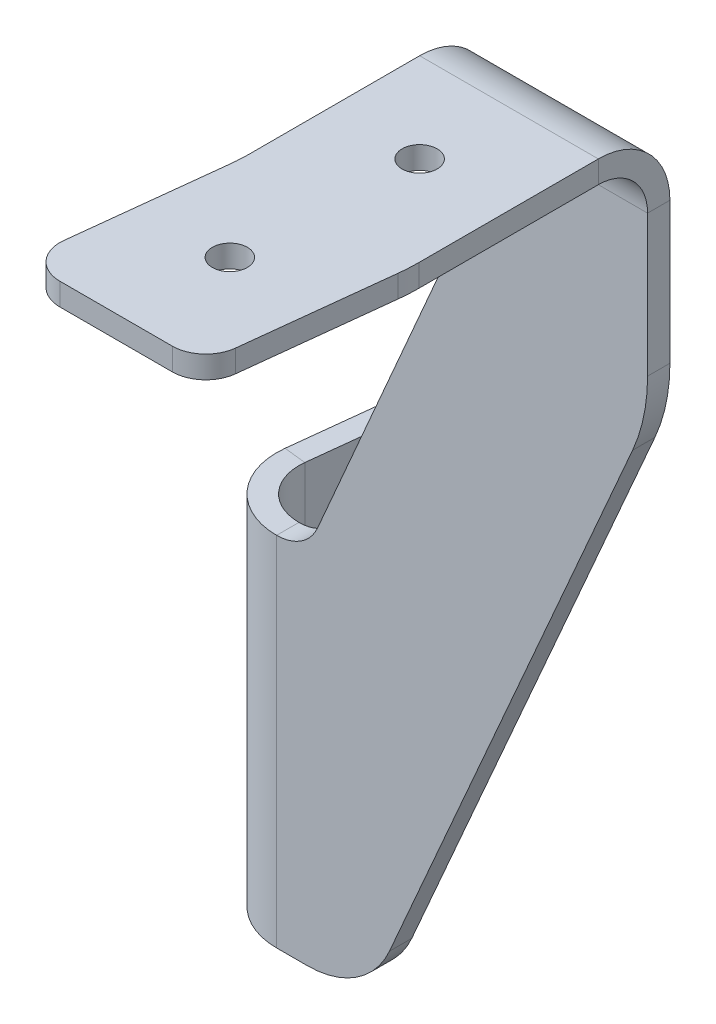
ISO-10303-21;
HEADER;
FILE_DESCRIPTION(('STEP AP214'),'2;1');
FILE_NAME('part.step','',(''),(''),'','','');
FILE_SCHEMA(('AUTOMOTIVE_DESIGN { 1 0 10303 214 1 1 1 1 }'));
ENDSEC;
DATA;
#1=APPLICATION_CONTEXT('core data for automotive mechanical design processes');
#2=APPLICATION_PROTOCOL_DEFINITION('international standard','automotive_design',2000,#1);
#3=PRODUCT_CONTEXT('',#1,'mechanical');
#4=PRODUCT('Part','Part','',(#3));
#5=PRODUCT_RELATED_PRODUCT_CATEGORY('part','',(#4));
#6=PRODUCT_DEFINITION_FORMATION('','',#4);
#7=PRODUCT_DEFINITION_CONTEXT('part definition',#1,'design');
#8=PRODUCT_DEFINITION('design','',#6,#7);
#9=PRODUCT_DEFINITION_SHAPE('','',#8);
#10=(LENGTH_UNIT() NAMED_UNIT(*) SI_UNIT(.MILLI.,.METRE.));
#11=(NAMED_UNIT(*) PLANE_ANGLE_UNIT() SI_UNIT($,.RADIAN.));
#12=(NAMED_UNIT(*) SI_UNIT($,.STERADIAN.) SOLID_ANGLE_UNIT());
#13=UNCERTAINTY_MEASURE_WITH_UNIT(LENGTH_MEASURE(1.E-05),#10,'distance_accuracy_value','');
#14=(GEOMETRIC_REPRESENTATION_CONTEXT(3) GLOBAL_UNCERTAINTY_ASSIGNED_CONTEXT((#13)) GLOBAL_UNIT_ASSIGNED_CONTEXT((#10,
#11,#12)) REPRESENTATION_CONTEXT('',''));
#15=CARTESIAN_POINT('',(0.,0.,0.));
#16=DIRECTION('',(0.,0.,1.));
#17=DIRECTION('',(1.,0.,0.));
#18=AXIS2_PLACEMENT_3D('',#15,#16,#17);
#19=CARTESIAN_POINT('',(52.7304,101.600000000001,63.5));
#20=DIRECTION('',(1.,0.,0.));
#21=DIRECTION('',(0.,0.,-1.));
#22=AXIS2_PLACEMENT_3D('',#19,#20,#21);
#23=PLANE('',#22);
#24=DIRECTION('',(0.,0.,1.));
#25=VECTOR('',#24,1.);
#26=CARTESIAN_POINT('',(52.7304,101.600000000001,63.5));
#27=LINE('',#26,#25);
#28=CARTESIAN_POINT('',(52.7304,101.600000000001,10.17499997));
#29=VERTEX_POINT('',#28);
#30=CARTESIAN_POINT('',(52.7304,101.600000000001,35.6447076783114));
#31=VERTEX_POINT('',#30);
#32=EDGE_CURVE('E393',#29,#31,#27,.T.);
#33=ORIENTED_EDGE('',*,*,#32,.T.);
#34=DIRECTION('',(0.,-1.,0.));
#35=VECTOR('',#34,1.);
#36=CARTESIAN_POINT('',(52.7304,101.600000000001,35.6447076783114));
#37=LINE('',#36,#35);
#38=CARTESIAN_POINT('',(52.7304,98.4250000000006,35.6447076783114));
#39=VERTEX_POINT('',#38);
#40=EDGE_CURVE('E606',#31,#39,#37,.T.);
#41=ORIENTED_EDGE('',*,*,#40,.T.);
#42=DIRECTION('',(0.,0.,-1.));
#43=VECTOR('',#42,1.);
#44=CARTESIAN_POINT('',(52.7304,98.4250000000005,-2.65647153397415E-13));
#45=LINE('',#44,#43);
#46=CARTESIAN_POINT('',(52.7304,98.4250000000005,10.17499997));
#47=VERTEX_POINT('',#46);
#48=EDGE_CURVE('E404',#47,#39,#45,.F.);
#49=ORIENTED_EDGE('',*,*,#48,.F.);
#50=DIRECTION('',(0.,1.,0.));
#51=VECTOR('',#50,1.);
#52=CARTESIAN_POINT('',(52.7304,101.600000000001,10.17499997));
#53=LINE('',#52,#51);
#54=EDGE_CURVE('E378',#47,#29,#53,.T.);
#55=ORIENTED_EDGE('',*,*,#54,.T.);
#56=EDGE_LOOP('',(#33,#41,#49,#55));
#57=FACE_BOUND('',#56,.T.);
#58=ADVANCED_FACE('F86',(#57),#23,.T.);
#59=CARTESIAN_POINT('',(0.,101.6,-2.82797930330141E-13));
#60=DIRECTION('',(0.,1.,0.));
#61=DIRECTION('',(0.,0.,1.));
#62=AXIS2_PLACEMENT_3D('',#59,#60,#61);
#63=PLANE('',#62);
#64=CARTESIAN_POINT('',(38.6615301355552,101.600000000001,48.4865088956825));
#65=DIRECTION('',(0.,-1.,0.));
#66=DIRECTION('',(0.,0.,-1.));
#67=AXIS2_PLACEMENT_3D('',#64,#65,#66);
#68=CIRCLE('',#67,2.4892);
#69=CARTESIAN_POINT('',(38.6615301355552,101.600000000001,45.9973088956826));
#70=VERTEX_POINT('',#69);
#71=EDGE_CURVE('E658',#70,#70,#68,.T.);
#72=ORIENTED_EDGE('',*,*,#71,.T.);
#73=EDGE_LOOP('',(#72));
#74=FACE_BOUND('',#73,.T.);
#75=CARTESIAN_POINT('',(40.0304,101.600000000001,22.8749999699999));
#76=DIRECTION('',(0.,1.,0.));
#77=DIRECTION('',(0.,0.,1.));
#78=AXIS2_PLACEMENT_3D('',#75,#76,#77);
#79=CIRCLE('',#78,2.4892);
#80=CARTESIAN_POINT('',(40.0304,101.600000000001,25.3641999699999));
#81=VERTEX_POINT('',#80);
#82=EDGE_CURVE('E514',#81,#81,#79,.T.);
#83=ORIENTED_EDGE('',*,*,#82,.F.);
#84=EDGE_LOOP('',(#83));
#85=FACE_BOUND('',#84,.T.);
#86=DIRECTION('',(-0.112162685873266,0.,0.993689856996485));
#87=VECTOR('',#86,1.);
#88=CARTESIAN_POINT('',(56.1990713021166,101.600000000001,6.34346696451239));
#89=LINE('',#88,#87);
#90=CARTESIAN_POINT('',(52.5701223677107,101.600000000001,38.4936398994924));
#91=VERTEX_POINT('',#90);
#92=CARTESIAN_POINT('',(50.2248028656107,101.600000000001,59.2716747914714));
#93=VERTEX_POINT('',#92);
#94=EDGE_CURVE('E656',#91,#93,#89,.T.);
#95=ORIENTED_EDGE('',*,*,#94,.F.);
#96=CARTESIAN_POINT('',(27.3304,101.600000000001,35.6447076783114));
#97=DIRECTION('',(0.,1.,0.));
#98=DIRECTION('',(0.,0.,1.));
#99=AXIS2_PLACEMENT_3D('',#96,#97,#98);
#100=CIRCLE('',#99,25.4);
#101=EDGE_CURVE('E603',#91,#31,#100,.T.);
#102=ORIENTED_EDGE('',*,*,#101,.T.);
#103=ORIENTED_EDGE('',*,*,#32,.F.);
#104=DIRECTION('',(-1.,0.,0.));
#105=VECTOR('',#104,1.);
#106=CARTESIAN_POINT('',(0.,101.600000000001,10.17499997));
#107=LINE('',#106,#105);
#108=CARTESIAN_POINT('',(27.3304,101.600000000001,10.17499997));
#109=VERTEX_POINT('',#108);
#110=EDGE_CURVE('E408',#29,#109,#107,.T.);
#111=ORIENTED_EDGE('',*,*,#110,.T.);
#112=DIRECTION('',(0.,0.,-1.));
#113=VECTOR('',#112,1.);
#114=CARTESIAN_POINT('',(27.3304,101.600000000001,3.17499999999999));
#115=LINE('',#114,#113);
#116=CARTESIAN_POINT('',(27.3304,101.600000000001,34.2157330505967));
#117=VERTEX_POINT('',#116);
#118=EDGE_CURVE('E385',#117,#109,#115,.T.);
#119=ORIENTED_EDGE('',*,*,#118,.F.);
#120=CARTESIAN_POINT('',(1.9304,101.600000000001,34.2157330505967));
#121=DIRECTION('',(0.,1.,0.));
#122=DIRECTION('',(0.,0.,1.));
#123=AXIS2_PLACEMENT_3D('',#120,#121,#122);
#124=CIRCLE('',#123,25.4);
#125=CARTESIAN_POINT('',(27.1701223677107,101.600000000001,37.0646652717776));
#126=VERTEX_POINT('',#125);
#127=EDGE_CURVE('E628',#117,#126,#124,.F.);
#128=ORIENTED_EDGE('',*,*,#127,.T.);
#129=DIRECTION('',(0.112162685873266,0.,-0.993689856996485));
#130=VECTOR('',#129,1.);
#131=CARTESIAN_POINT('',(30.9593489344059,101.600000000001,3.49453474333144));
#132=LINE('',#131,#130);
#133=CARTESIAN_POINT('',(24.7840973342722,101.600000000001,58.2033252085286));
#134=VERTEX_POINT('',#133);
#135=EDGE_CURVE('E661',#134,#126,#132,.T.);
#136=ORIENTED_EDGE('',*,*,#135,.F.);
#137=CARTESIAN_POINT('',(29.5165452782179,101.600000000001,58.7375));
#138=DIRECTION('',(0.,1.,0.));
#139=DIRECTION('',(0.,0.,1.));
#140=AXIS2_PLACEMENT_3D('',#137,#138,#139);
#141=CIRCLE('',#140,4.7625);
#142=CARTESIAN_POINT('',(29.5165452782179,101.600000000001,63.5));
#143=VERTEX_POINT('',#142);
#144=EDGE_CURVE('E557',#134,#143,#141,.T.);
#145=ORIENTED_EDGE('',*,*,#144,.T.);
#146=DIRECTION('',(-1.,0.,0.));
#147=VECTOR('',#146,1.);
#148=CARTESIAN_POINT('',(27.3304,101.600000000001,63.5));
#149=LINE('',#148,#147);
#150=CARTESIAN_POINT('',(45.492354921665,101.600000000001,63.5));
#151=VERTEX_POINT('',#150);
#152=EDGE_CURVE('E389',#151,#143,#149,.T.);
#153=ORIENTED_EDGE('',*,*,#152,.F.);
#154=CARTESIAN_POINT('',(45.492354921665,101.600000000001,58.7375));
#155=DIRECTION('',(0.,1.,0.));
#156=DIRECTION('',(0.,0.,1.));
#157=AXIS2_PLACEMENT_3D('',#154,#155,#156);
#158=CIRCLE('',#157,4.7625);
#159=EDGE_CURVE('E560',#151,#93,#158,.T.);
#160=ORIENTED_EDGE('',*,*,#159,.T.);
#161=EDGE_LOOP('',(#95,#102,#103,#111,#119,#128,#136,#145,#153,#160));
#162=FACE_BOUND('',#161,.T.);
#163=ADVANCED_FACE('F750',(#74,#85,#162),#63,.T.);
#164=CARTESIAN_POINT('',(0.,98.4250000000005,-2.71712477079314E-13));
#165=DIRECTION('',(0.,1.,0.));
#166=DIRECTION('',(0.,0.,1.));
#167=AXIS2_PLACEMENT_3D('',#164,#165,#166);
#168=PLANE('',#167);
#169=CARTESIAN_POINT('',(40.0304,98.4250000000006,22.8749999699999));
#170=DIRECTION('',(0.,1.,0.));
#171=DIRECTION('',(0.,0.,1.));
#172=AXIS2_PLACEMENT_3D('',#169,#170,#171);
#173=CIRCLE('',#172,2.4892);
#174=CARTESIAN_POINT('',(40.0304,98.4250000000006,25.3641999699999));
#175=VERTEX_POINT('',#174);
#176=EDGE_CURVE('E377',#175,#175,#173,.T.);
#177=ORIENTED_EDGE('',*,*,#176,.T.);
#178=EDGE_LOOP('',(#177));
#179=FACE_BOUND('',#178,.T.);
#180=CARTESIAN_POINT('',(38.6615301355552,98.4250000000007,48.4865088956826));
#181=DIRECTION('',(0.,-1.,0.));
#182=DIRECTION('',(0.,0.,-1.));
#183=AXIS2_PLACEMENT_3D('',#180,#181,#182);
#184=CIRCLE('',#183,2.4892);
#185=CARTESIAN_POINT('',(38.6615301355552,98.4250000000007,45.9973088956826));
#186=VERTEX_POINT('',#185);
#187=EDGE_CURVE('E650',#186,#186,#184,.T.);
#188=ORIENTED_EDGE('',*,*,#187,.F.);
#189=EDGE_LOOP('',(#188));
#190=FACE_BOUND('',#189,.T.);
#191=ORIENTED_EDGE('',*,*,#48,.T.);
#192=CARTESIAN_POINT('',(27.3304,98.4250000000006,35.6447076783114));
#193=DIRECTION('',(0.,1.,0.));
#194=DIRECTION('',(0.,0.,1.));
#195=AXIS2_PLACEMENT_3D('',#192,#193,#194);
#196=CIRCLE('',#195,25.4);
#197=CARTESIAN_POINT('',(52.5701223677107,98.4250000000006,38.4936398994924));
#198=VERTEX_POINT('',#197);
#199=EDGE_CURVE('E609',#39,#198,#196,.F.);
#200=ORIENTED_EDGE('',*,*,#199,.T.);
#201=DIRECTION('',(-0.112162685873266,0.,0.993689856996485));
#202=VECTOR('',#201,1.);
#203=CARTESIAN_POINT('',(56.1990713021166,98.4250000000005,6.3434669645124));
#204=LINE('',#203,#202);
#205=CARTESIAN_POINT('',(50.2248028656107,98.4250000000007,59.2716747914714));
#206=VERTEX_POINT('',#205);
#207=EDGE_CURVE('E659',#198,#206,#204,.T.);
#208=ORIENTED_EDGE('',*,*,#207,.T.);
#209=CARTESIAN_POINT('',(45.492354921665,98.4250000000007,58.7375));
#210=DIRECTION('',(0.,1.,0.));
#211=DIRECTION('',(0.,0.,1.));
#212=AXIS2_PLACEMENT_3D('',#209,#210,#211);
#213=CIRCLE('',#212,4.7625);
#214=CARTESIAN_POINT('',(45.492354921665,98.4250000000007,63.5));
#215=VERTEX_POINT('',#214);
#216=EDGE_CURVE('E571',#206,#215,#213,.F.);
#217=ORIENTED_EDGE('',*,*,#216,.T.);
#218=DIRECTION('',(1.,0.,0.));
#219=VECTOR('',#218,1.);
#220=CARTESIAN_POINT('',(0.,98.4250000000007,63.5));
#221=LINE('',#220,#219);
#222=CARTESIAN_POINT('',(29.5165452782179,98.4250000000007,63.5));
#223=VERTEX_POINT('',#222);
#224=EDGE_CURVE('E400',#215,#223,#221,.F.);
#225=ORIENTED_EDGE('',*,*,#224,.T.);
#226=CARTESIAN_POINT('',(29.5165452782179,98.4250000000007,58.7375));
#227=DIRECTION('',(0.,1.,0.));
#228=DIRECTION('',(0.,0.,1.));
#229=AXIS2_PLACEMENT_3D('',#226,#227,#228);
#230=CIRCLE('',#229,4.7625);
#231=CARTESIAN_POINT('',(24.7840973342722,98.4250000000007,58.2033252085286));
#232=VERTEX_POINT('',#231);
#233=EDGE_CURVE('E568',#223,#232,#230,.F.);
#234=ORIENTED_EDGE('',*,*,#233,.T.);
#235=DIRECTION('',(0.112162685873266,0.,-0.993689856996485));
#236=VECTOR('',#235,1.);
#237=CARTESIAN_POINT('',(30.9593489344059,98.4250000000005,3.49453474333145));
#238=LINE('',#237,#236);
#239=CARTESIAN_POINT('',(27.1701223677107,98.4250000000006,37.0646652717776));
#240=VERTEX_POINT('',#239);
#241=EDGE_CURVE('E665',#232,#240,#238,.T.);
#242=ORIENTED_EDGE('',*,*,#241,.T.);
#243=CARTESIAN_POINT('',(1.9304,98.4250000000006,34.2157330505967));
#244=DIRECTION('',(0.,1.,0.));
#245=DIRECTION('',(0.,0.,1.));
#246=AXIS2_PLACEMENT_3D('',#243,#244,#245);
#247=CIRCLE('',#246,25.4);
#248=CARTESIAN_POINT('',(27.3304,98.4250000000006,34.2157330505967));
#249=VERTEX_POINT('',#248);
#250=EDGE_CURVE('E625',#240,#249,#247,.T.);
#251=ORIENTED_EDGE('',*,*,#250,.T.);
#252=DIRECTION('',(0.,0.,1.));
#253=VECTOR('',#252,1.);
#254=CARTESIAN_POINT('',(27.3304,98.4250000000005,-2.71712477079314E-13));
#255=LINE('',#254,#253);
#256=CARTESIAN_POINT('',(27.3304,98.4250000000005,10.17499997));
#257=VERTEX_POINT('',#256);
#258=EDGE_CURVE('E397',#249,#257,#255,.F.);
#259=ORIENTED_EDGE('',*,*,#258,.T.);
#260=DIRECTION('',(1.,0.,0.));
#261=VECTOR('',#260,1.);
#262=CARTESIAN_POINT('',(52.7304,98.4250000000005,10.17499997));
#263=LINE('',#262,#261);
#264=EDGE_CURVE('E416',#47,#257,#263,.F.);
#265=ORIENTED_EDGE('',*,*,#264,.F.);
#266=EDGE_LOOP('',(#191,#200,#208,#217,#225,#234,#242,#251,#259,#265));
#267=FACE_BOUND('',#266,.T.);
#268=ADVANCED_FACE('F762',(#179,#190,#267),#168,.F.);
#269=CARTESIAN_POINT('',(27.3304,101.600000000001,63.5));
#270=DIRECTION('',(0.,0.,1.));
#271=DIRECTION('',(0.,-1.,0.));
#272=AXIS2_PLACEMENT_3D('',#269,#270,#271);
#273=PLANE('',#272);
#274=ORIENTED_EDGE('',*,*,#224,.F.);
#275=DIRECTION('',(0.,-1.,0.));
#276=VECTOR('',#275,1.);
#277=CARTESIAN_POINT('',(45.492354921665,101.600000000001,63.5));
#278=LINE('',#277,#276);
#279=EDGE_CURVE('E553',#215,#151,#278,.F.);
#280=ORIENTED_EDGE('',*,*,#279,.T.);
#281=ORIENTED_EDGE('',*,*,#152,.T.);
#282=DIRECTION('',(0.,-1.,0.));
#283=VECTOR('',#282,1.);
#284=CARTESIAN_POINT('',(29.5165452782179,101.600000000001,63.5));
#285=LINE('',#284,#283);
#286=EDGE_CURVE('E549',#143,#223,#285,.T.);
#287=ORIENTED_EDGE('',*,*,#286,.T.);
#288=EDGE_LOOP('',(#274,#280,#281,#287));
#289=FACE_BOUND('',#288,.T.);
#290=ADVANCED_FACE('F785',(#289),#273,.T.);
#291=CARTESIAN_POINT('',(0.,31.75,0.));
#292=DIRECTION('',(0.,0.,-1.));
#293=DIRECTION('',(-1.,0.,0.));
#294=AXIS2_PLACEMENT_3D('',#291,#292,#293);
#295=CYLINDRICAL_SURFACE('',#294,6.35);
#296=DIRECTION('',(0.,0.,-1.));
#297=VECTOR('',#296,1.);
#298=CARTESIAN_POINT('',(0.,25.4,0.));
#299=LINE('',#298,#297);
#300=CARTESIAN_POINT('',(0.,25.4,3.175));
#301=VERTEX_POINT('',#300);
#302=CARTESIAN_POINT('',(0.,25.4,0.));
#303=VERTEX_POINT('',#302);
#304=EDGE_CURVE('E504',#301,#303,#299,.T.);
#305=ORIENTED_EDGE('',*,*,#304,.F.);
#306=CARTESIAN_POINT('',(0.,31.75,3.175));
#307=DIRECTION('',(0.,0.,-1.));
#308=DIRECTION('',(-1.,0.,0.));
#309=AXIS2_PLACEMENT_3D('',#306,#307,#308);
#310=CIRCLE('',#309,6.35);
#311=CARTESIAN_POINT('',(5.82443774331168,29.220489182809,3.175));
#312=VERTEX_POINT('',#311);
#313=EDGE_CURVE('E494',#312,#301,#310,.T.);
#314=ORIENTED_EDGE('',*,*,#313,.F.);
#315=DIRECTION('',(0.,0.,-1.));
#316=VECTOR('',#315,1.);
#317=CARTESIAN_POINT('',(5.82443774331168,29.220489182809,0.));
#318=LINE('',#317,#316);
#319=CARTESIAN_POINT('',(5.82443774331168,29.220489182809,0.));
#320=VERTEX_POINT('',#319);
#321=EDGE_CURVE('E500',#312,#320,#318,.T.);
#322=ORIENTED_EDGE('',*,*,#321,.T.);
#323=CARTESIAN_POINT('',(0.,31.75,0.));
#324=DIRECTION('',(0.,0.,-1.));
#325=DIRECTION('',(1.,0.,0.));
#326=AXIS2_PLACEMENT_3D('',#323,#324,#325);
#327=CIRCLE('',#326,6.35);
#328=EDGE_CURVE('E470',#320,#303,#327,.T.);
#329=ORIENTED_EDGE('',*,*,#328,.T.);
#330=EDGE_LOOP('',(#305,#314,#322,#329));
#331=FACE_BOUND('',#330,.T.);
#332=ADVANCED_FACE('F709',(#331),#295,.F.);
#333=CARTESIAN_POINT('',(27.3304,78.74,0.));
#334=DIRECTION('',(-0.917234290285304,0.398348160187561,0.));
#335=DIRECTION('',(-0.398348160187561,-0.917234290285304,0.));
#336=AXIS2_PLACEMENT_3D('',#333,#334,#335);
#337=PLANE('',#336);
#338=DIRECTION('',(-0.398348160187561,-0.917234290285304,0.));
#339=VECTOR('',#338,1.);
#340=CARTESIAN_POINT('',(27.3304,78.74,3.175));
#341=LINE('',#340,#339);
#342=CARTESIAN_POINT('',(25.2281509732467,73.8993729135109,3.175));
#343=VERTEX_POINT('',#342);
#344=EDGE_CURVE('E491',#343,#312,#341,.T.);
#345=ORIENTED_EDGE('',*,*,#344,.F.);
#346=DIRECTION('',(0.,0.,-1.));
#347=VECTOR('',#346,1.);
#348=CARTESIAN_POINT('',(25.2281509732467,73.8993729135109,0.));
#349=LINE('',#348,#347);
#350=CARTESIAN_POINT('',(25.2281509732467,73.8993729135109,0.));
#351=VERTEX_POINT('',#350);
#352=EDGE_CURVE('E577',#343,#351,#349,.T.);
#353=ORIENTED_EDGE('',*,*,#352,.T.);
#354=DIRECTION('',(-0.398348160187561,-0.917234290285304,0.));
#355=VECTOR('',#354,1.);
#356=CARTESIAN_POINT('',(27.3304,78.74,0.));
#357=LINE('',#356,#355);
#358=EDGE_CURVE('E474',#351,#320,#357,.T.);
#359=ORIENTED_EDGE('',*,*,#358,.T.);
#360=ORIENTED_EDGE('',*,*,#321,.F.);
#361=EDGE_LOOP('',(#345,#353,#359,#360));
#362=FACE_BOUND('',#361,.T.);
#363=ADVANCED_FACE('F714',(#362),#337,.T.);
#364=CARTESIAN_POINT('',(52.7304,66.04,0.));
#365=DIRECTION('',(1.,0.,0.));
#366=DIRECTION('',(0.,1.,0.));
#367=AXIS2_PLACEMENT_3D('',#364,#365,#366);
#368=PLANE('',#367);
#369=DIRECTION('',(0.,1.,0.));
#370=VECTOR('',#369,1.);
#371=CARTESIAN_POINT('',(52.7304,31.75,3.175));
#372=LINE('',#371,#370);
#373=CARTESIAN_POINT('',(52.7304,71.3562231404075,3.175));
#374=VERTEX_POINT('',#373);
#375=CARTESIAN_POINT('',(52.7304,91.4250000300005,3.17499999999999));
#376=VERTEX_POINT('',#375);
#377=EDGE_CURVE('E488',#374,#376,#372,.T.);
#378=ORIENTED_EDGE('',*,*,#377,.F.);
#379=DIRECTION('',(0.,0.,-1.));
#380=VECTOR('',#379,1.);
#381=CARTESIAN_POINT('',(52.7304,71.3562231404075,0.));
#382=LINE('',#381,#380);
#383=CARTESIAN_POINT('',(52.7304,71.3562231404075,0.));
#384=VERTEX_POINT('',#383);
#385=EDGE_CURVE('E584',#374,#384,#382,.T.);
#386=ORIENTED_EDGE('',*,*,#385,.T.);
#387=DIRECTION('',(0.,1.,0.));
#388=VECTOR('',#387,1.);
#389=CARTESIAN_POINT('',(52.7304,66.04,0.));
#390=LINE('',#389,#388);
#391=CARTESIAN_POINT('',(52.7304,91.4250000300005,0.));
#392=VERTEX_POINT('',#391);
#393=EDGE_CURVE('E477',#384,#392,#390,.T.);
#394=ORIENTED_EDGE('',*,*,#393,.T.);
#395=DIRECTION('',(0.,0.,-1.));
#396=VECTOR('',#395,1.);
#397=CARTESIAN_POINT('',(52.7304,91.4250000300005,3.17499999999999));
#398=LINE('',#397,#396);
#399=EDGE_CURVE('E447',#376,#392,#398,.T.);
#400=ORIENTED_EDGE('',*,*,#399,.F.);
#401=EDGE_LOOP('',(#378,#386,#394,#400));
#402=FACE_BOUND('',#401,.T.);
#403=ADVANCED_FACE('F737',(#402),#368,.T.);
#404=CARTESIAN_POINT('',(12.7,-25.4,0.));
#405=DIRECTION('',(0.916063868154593,-0.401032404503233,0.));
#406=DIRECTION('',(0.401032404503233,0.916063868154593,0.));
#407=AXIS2_PLACEMENT_3D('',#404,#405,#406);
#408=PLANE('',#407);
#409=DIRECTION('',(0.401032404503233,0.916063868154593,0.));
#410=VECTOR('',#409,1.);
#411=CARTESIAN_POINT('',(12.7,-25.4,3.175));
#412=LINE('',#411,#410);
#413=CARTESIAN_POINT('',(16.0301267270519,-17.7931115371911,3.175));
#414=VERTEX_POINT('',#413);
#415=CARTESIAN_POINT('',(50.5984222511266,61.1700000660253,3.175));
#416=VERTEX_POINT('',#415);
#417=EDGE_CURVE('E467',#414,#416,#412,.T.);
#418=ORIENTED_EDGE('',*,*,#417,.F.);
#419=DIRECTION('',(0.,0.,-1.));
#420=VECTOR('',#419,1.);
#421=CARTESIAN_POINT('',(16.0301267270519,-17.7931115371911,0.));
#422=LINE('',#421,#420);
#423=CARTESIAN_POINT('',(16.0301267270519,-17.7931115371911,0.));
#424=VERTEX_POINT('',#423);
#425=EDGE_CURVE('E631',#414,#424,#422,.T.);
#426=ORIENTED_EDGE('',*,*,#425,.T.);
#427=DIRECTION('',(0.401032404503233,0.916063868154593,0.));
#428=VECTOR('',#427,1.);
#429=CARTESIAN_POINT('',(12.7,-25.4,0.));
#430=LINE('',#429,#428);
#431=CARTESIAN_POINT('',(50.5984222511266,61.1700000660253,0.));
#432=VERTEX_POINT('',#431);
#433=EDGE_CURVE('E480',#424,#432,#430,.T.);
#434=ORIENTED_EDGE('',*,*,#433,.T.);
#435=DIRECTION('',(0.,0.,-1.));
#436=VECTOR('',#435,1.);
#437=CARTESIAN_POINT('',(50.5984222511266,61.1700000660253,0.));
#438=LINE('',#437,#436);
#439=EDGE_CURVE('E592',#432,#416,#438,.F.);
#440=ORIENTED_EDGE('',*,*,#439,.T.);
#441=EDGE_LOOP('',(#418,#426,#434,#440));
#442=FACE_BOUND('',#441,.T.);
#443=ADVANCED_FACE('F824',(#442),#408,.T.);
#444=CARTESIAN_POINT('',(0.,-25.4,0.));
#445=DIRECTION('',(0.,-1.,0.));
#446=DIRECTION('',(1.,0.,0.));
#447=AXIS2_PLACEMENT_3D('',#444,#445,#446);
#448=PLANE('',#447);
#449=DIRECTION('',(1.,0.,0.));
#450=VECTOR('',#449,1.);
#451=CARTESIAN_POINT('',(0.,-25.4,0.));
#452=LINE('',#451,#450);
#453=CARTESIAN_POINT('',(0.,-25.4,0.));
#454=VERTEX_POINT('',#453);
#455=CARTESIAN_POINT('',(4.39611560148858,-25.4,0.));
#456=VERTEX_POINT('',#455);
#457=EDGE_CURVE('E463',#454,#456,#452,.T.);
#458=ORIENTED_EDGE('',*,*,#457,.T.);
#459=DIRECTION('',(0.,0.,-1.));
#460=VECTOR('',#459,1.);
#461=CARTESIAN_POINT('',(4.39611560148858,-25.4,0.));
#462=LINE('',#461,#460);
#463=CARTESIAN_POINT('',(4.39611560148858,-25.4,3.175));
#464=VERTEX_POINT('',#463);
#465=EDGE_CURVE('E95',#456,#464,#462,.F.);
#466=ORIENTED_EDGE('',*,*,#465,.T.);
#467=DIRECTION('',(1.,0.,0.));
#468=VECTOR('',#467,1.);
#469=CARTESIAN_POINT('',(0.,-25.4,3.175));
#470=LINE('',#469,#468);
#471=CARTESIAN_POINT('',(0.,-25.4,3.175));
#472=VERTEX_POINT('',#471);
#473=EDGE_CURVE('E462',#472,#464,#470,.T.);
#474=ORIENTED_EDGE('',*,*,#473,.F.);
#475=DIRECTION('',(0.,0.,-1.));
#476=VECTOR('',#475,1.);
#477=CARTESIAN_POINT('',(0.,-25.4,0.));
#478=LINE('',#477,#476);
#479=EDGE_CURVE('E483',#472,#454,#478,.T.);
#480=ORIENTED_EDGE('',*,*,#479,.T.);
#481=EDGE_LOOP('',(#458,#466,#474,#480));
#482=FACE_BOUND('',#481,.T.);
#483=ADVANCED_FACE('F704',(#482),#448,.T.);
#484=CARTESIAN_POINT('',(0.,31.75,0.));
#485=DIRECTION('',(0.,0.,1.));
#486=DIRECTION('',(1.,0.,0.));
#487=AXIS2_PLACEMENT_3D('',#484,#485,#486);
#488=PLANE('',#487);
#489=ORIENTED_EDGE('',*,*,#433,.F.);
#490=CARTESIAN_POINT('',(4.39611560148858,-12.7,0.));
#491=DIRECTION('',(0.,0.,1.));
#492=DIRECTION('',(1.,0.,0.));
#493=AXIS2_PLACEMENT_3D('',#490,#491,#492);
#494=CIRCLE('',#493,12.7);
#495=EDGE_CURVE('E115',#424,#456,#494,.F.);
#496=ORIENTED_EDGE('',*,*,#495,.T.);
#497=ORIENTED_EDGE('',*,*,#457,.F.);
#498=DIRECTION('',(0.,-1.,0.));
#499=VECTOR('',#498,1.);
#500=CARTESIAN_POINT('',(0.,-25.4,0.));
#501=LINE('',#500,#499);
#502=EDGE_CURVE('E466',#303,#454,#501,.T.);
#503=ORIENTED_EDGE('',*,*,#502,.F.);
#504=ORIENTED_EDGE('',*,*,#328,.F.);
#505=ORIENTED_EDGE('',*,*,#358,.F.);
#506=CARTESIAN_POINT('',(1.9304,84.0174161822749,0.));
#507=DIRECTION('',(0.,0.,1.));
#508=DIRECTION('',(1.,0.,0.));
#509=AXIS2_PLACEMENT_3D('',#506,#507,#508);
#510=CIRCLE('',#509,25.4);
#511=CARTESIAN_POINT('',(27.3304,84.0174161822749,0.));
#512=VERTEX_POINT('',#511);
#513=EDGE_CURVE('E619',#351,#512,#510,.T.);
#514=ORIENTED_EDGE('',*,*,#513,.T.);
#515=DIRECTION('',(0.,-1.,0.));
#516=VECTOR('',#515,1.);
#517=CARTESIAN_POINT('',(27.3304,91.4250000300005,0.));
#518=LINE('',#517,#516);
#519=CARTESIAN_POINT('',(27.3304,91.4250000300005,0.));
#520=VERTEX_POINT('',#519);
#521=EDGE_CURVE('E451',#520,#512,#518,.T.);
#522=ORIENTED_EDGE('',*,*,#521,.F.);
#523=DIRECTION('',(-1.,0.,0.));
#524=VECTOR('',#523,1.);
#525=CARTESIAN_POINT('',(27.3304,91.4250000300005,0.));
#526=LINE('',#525,#524);
#527=EDGE_CURVE('E423',#520,#392,#526,.F.);
#528=ORIENTED_EDGE('',*,*,#527,.T.);
#529=ORIENTED_EDGE('',*,*,#393,.F.);
#530=CARTESIAN_POINT('',(27.3304,71.3562231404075,0.));
#531=DIRECTION('',(0.,0.,1.));
#532=DIRECTION('',(1.,0.,0.));
#533=AXIS2_PLACEMENT_3D('',#530,#531,#532);
#534=CIRCLE('',#533,25.4);
#535=EDGE_CURVE('E588',#384,#432,#534,.F.);
#536=ORIENTED_EDGE('',*,*,#535,.T.);
#537=EDGE_LOOP('',(#489,#496,#497,#503,#504,#505,#514,#522,#528,#529,#536));
#538=FACE_BOUND('',#537,.T.);
#539=ADVANCED_FACE('F705',(#538),#488,.F.);
#540=CARTESIAN_POINT('',(0.,31.75,3.175));
#541=DIRECTION('',(0.,0.,1.));
#542=DIRECTION('',(1.,0.,0.));
#543=AXIS2_PLACEMENT_3D('',#540,#541,#542);
#544=PLANE('',#543);
#545=ORIENTED_EDGE('',*,*,#473,.T.);
#546=CARTESIAN_POINT('',(4.39611560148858,-12.7,3.175));
#547=DIRECTION('',(0.,0.,1.));
#548=DIRECTION('',(1.,0.,0.));
#549=AXIS2_PLACEMENT_3D('',#546,#547,#548);
#550=CIRCLE('',#549,12.7);
#551=EDGE_CURVE('E13',#464,#414,#550,.T.);
#552=ORIENTED_EDGE('',*,*,#551,.T.);
#553=ORIENTED_EDGE('',*,*,#417,.T.);
#554=CARTESIAN_POINT('',(27.3304,71.3562231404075,3.175));
#555=DIRECTION('',(0.,0.,1.));
#556=DIRECTION('',(1.,0.,0.));
#557=AXIS2_PLACEMENT_3D('',#554,#555,#556);
#558=CIRCLE('',#557,25.4);
#559=EDGE_CURVE('E596',#416,#374,#558,.T.);
#560=ORIENTED_EDGE('',*,*,#559,.T.);
#561=ORIENTED_EDGE('',*,*,#377,.T.);
#562=DIRECTION('',(-1.,0.,0.));
#563=VECTOR('',#562,1.);
#564=CARTESIAN_POINT('',(27.3304,91.4250000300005,3.17499999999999));
#565=LINE('',#564,#563);
#566=CARTESIAN_POINT('',(27.3304,91.4250000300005,3.17499999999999));
#567=VERTEX_POINT('',#566);
#568=EDGE_CURVE('E440',#567,#376,#565,.F.);
#569=ORIENTED_EDGE('',*,*,#568,.F.);
#570=DIRECTION('',(0.,-1.,0.));
#571=VECTOR('',#570,1.);
#572=CARTESIAN_POINT('',(27.3304,91.4250000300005,3.17499999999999));
#573=LINE('',#572,#571);
#574=CARTESIAN_POINT('',(27.3304,84.0174161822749,3.17499999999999));
#575=VERTEX_POINT('',#574);
#576=EDGE_CURVE('E458',#567,#575,#573,.T.);
#577=ORIENTED_EDGE('',*,*,#576,.T.);
#578=CARTESIAN_POINT('',(1.9304,84.0174161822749,3.175));
#579=DIRECTION('',(0.,0.,1.));
#580=DIRECTION('',(1.,0.,0.));
#581=AXIS2_PLACEMENT_3D('',#578,#579,#580);
#582=CIRCLE('',#581,25.4);
#583=EDGE_CURVE('E622',#575,#343,#582,.F.);
#584=ORIENTED_EDGE('',*,*,#583,.T.);
#585=ORIENTED_EDGE('',*,*,#344,.T.);
#586=ORIENTED_EDGE('',*,*,#313,.T.);
#587=DIRECTION('',(0.,1.,0.));
#588=VECTOR('',#587,1.);
#589=CARTESIAN_POINT('',(0.,31.75,3.175));
#590=LINE('',#589,#588);
#591=EDGE_CURVE('E342',#301,#472,#590,.F.);
#592=ORIENTED_EDGE('',*,*,#591,.T.);
#593=EDGE_LOOP('',(#545,#552,#553,#560,#561,#569,#577,#584,#585,#586,#592));
#594=FACE_BOUND('',#593,.T.);
#595=ADVANCED_FACE('F725',(#594),#544,.T.);
#596=CARTESIAN_POINT('',(27.3304,91.4250000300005,3.17499999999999));
#597=DIRECTION('',(-1.,0.,0.));
#598=DIRECTION('',(0.,0.,-1.));
#599=AXIS2_PLACEMENT_3D('',#596,#597,#598);
#600=PLANE('',#599);
#601=ORIENTED_EDGE('',*,*,#521,.T.);
#602=DIRECTION('',(0.,0.,-1.));
#603=VECTOR('',#602,1.);
#604=CARTESIAN_POINT('',(27.3304,84.0174161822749,3.175));
#605=LINE('',#604,#603);
#606=EDGE_CURVE('E581',#512,#575,#605,.F.);
#607=ORIENTED_EDGE('',*,*,#606,.T.);
#608=ORIENTED_EDGE('',*,*,#576,.F.);
#609=DIRECTION('',(0.,0.,-1.));
#610=VECTOR('',#609,1.);
#611=CARTESIAN_POINT('',(27.3304,91.4250000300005,3.17499999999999));
#612=LINE('',#611,#610);
#613=EDGE_CURVE('E432',#567,#520,#612,.T.);
#614=ORIENTED_EDGE('',*,*,#613,.T.);
#615=EDGE_LOOP('',(#601,#607,#608,#614));
#616=FACE_BOUND('',#615,.T.);
#617=ADVANCED_FACE('F720',(#616),#600,.T.);
#618=CARTESIAN_POINT('',(52.7304,91.4250000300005,10.17499997));
#619=DIRECTION('',(1.,0.,0.));
#620=DIRECTION('',(0.,0.,-1.));
#621=AXIS2_PLACEMENT_3D('',#618,#619,#620);
#622=PLANE('',#621);
#623=ORIENTED_EDGE('',*,*,#54,.F.);
#624=CARTESIAN_POINT('',(52.7304,91.4250000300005,10.17499997));
#625=DIRECTION('',(-1.,0.,0.));
#626=DIRECTION('',(0.,0.,1.));
#627=AXIS2_PLACEMENT_3D('',#624,#625,#626);
#628=CIRCLE('',#627,6.99999997);
#629=EDGE_CURVE('E436',#376,#47,#628,.F.);
#630=ORIENTED_EDGE('',*,*,#629,.F.);
#631=ORIENTED_EDGE('',*,*,#399,.T.);
#632=CARTESIAN_POINT('',(52.7304,91.4250000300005,10.17499997));
#633=DIRECTION('',(-1.,0.,0.));
#634=DIRECTION('',(0.,0.,1.));
#635=AXIS2_PLACEMENT_3D('',#632,#633,#634);
#636=CIRCLE('',#635,10.17499997);
#637=EDGE_CURVE('E427',#392,#29,#636,.F.);
#638=ORIENTED_EDGE('',*,*,#637,.T.);
#639=EDGE_LOOP('',(#623,#630,#631,#638));
#640=FACE_BOUND('',#639,.T.);
#641=ADVANCED_FACE('F735',(#640),#622,.T.);
#642=CARTESIAN_POINT('',(27.3304,91.4250000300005,10.17499997));
#643=DIRECTION('',(1.,0.,0.));
#644=DIRECTION('',(0.,0.,-1.));
#645=AXIS2_PLACEMENT_3D('',#642,#643,#644);
#646=PLANE('',#645);
#647=CARTESIAN_POINT('',(27.3304,91.4250000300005,10.17499997));
#648=DIRECTION('',(-1.,0.,0.));
#649=DIRECTION('',(0.,0.,1.));
#650=AXIS2_PLACEMENT_3D('',#647,#648,#649);
#651=CIRCLE('',#650,6.99999997);
#652=EDGE_CURVE('E388',#257,#567,#651,.T.);
#653=ORIENTED_EDGE('',*,*,#652,.F.);
#654=DIRECTION('',(0.,1.,0.));
#655=VECTOR('',#654,1.);
#656=CARTESIAN_POINT('',(27.3304,98.4250000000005,10.17499997));
#657=LINE('',#656,#655);
#658=EDGE_CURVE('E412',#257,#109,#657,.T.);
#659=ORIENTED_EDGE('',*,*,#658,.T.);
#660=CARTESIAN_POINT('',(27.3304,91.4250000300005,10.17499997));
#661=DIRECTION('',(-1.,0.,0.));
#662=DIRECTION('',(0.,0.,1.));
#663=AXIS2_PLACEMENT_3D('',#660,#661,#662);
#664=CIRCLE('',#663,10.17499997);
#665=EDGE_CURVE('E428',#109,#520,#664,.T.);
#666=ORIENTED_EDGE('',*,*,#665,.T.);
#667=ORIENTED_EDGE('',*,*,#613,.F.);
#668=EDGE_LOOP('',(#653,#659,#666,#667));
#669=FACE_BOUND('',#668,.T.);
#670=ADVANCED_FACE('F767',(#669),#646,.F.);
#671=CARTESIAN_POINT('',(27.3304,91.4250000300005,10.17499997));
#672=DIRECTION('',(-1.,0.,0.));
#673=DIRECTION('',(0.,1.,0.));
#674=AXIS2_PLACEMENT_3D('',#671,#672,#673);
#675=CYLINDRICAL_SURFACE('',#674,10.17499997);
#676=ORIENTED_EDGE('',*,*,#527,.F.);
#677=ORIENTED_EDGE('',*,*,#665,.F.);
#678=ORIENTED_EDGE('',*,*,#110,.F.);
#679=ORIENTED_EDGE('',*,*,#637,.F.);
#680=EDGE_LOOP('',(#676,#677,#678,#679));
#681=FACE_BOUND('',#680,.T.);
#682=ADVANCED_FACE('F742',(#681),#675,.T.);
#683=CARTESIAN_POINT('',(27.3304,91.4250000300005,10.17499997));
#684=DIRECTION('',(-1.,0.,0.));
#685=DIRECTION('',(0.,1.,0.));
#686=AXIS2_PLACEMENT_3D('',#683,#684,#685);
#687=CYLINDRICAL_SURFACE('',#686,6.99999997);
#688=ORIENTED_EDGE('',*,*,#568,.T.);
#689=ORIENTED_EDGE('',*,*,#629,.T.);
#690=ORIENTED_EDGE('',*,*,#264,.T.);
#691=ORIENTED_EDGE('',*,*,#652,.T.);
#692=EDGE_LOOP('',(#688,#689,#690,#691));
#693=FACE_BOUND('',#692,.T.);
#694=ADVANCED_FACE('F730',(#693),#687,.F.);
#695=CARTESIAN_POINT('',(27.3304,101.600000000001,3.17499999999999));
#696=DIRECTION('',(-1.,0.,0.));
#697=DIRECTION('',(0.,0.,1.));
#698=AXIS2_PLACEMENT_3D('',#695,#696,#697);
#699=PLANE('',#698);
#700=ORIENTED_EDGE('',*,*,#258,.F.);
#701=DIRECTION('',(0.,-1.,0.));
#702=VECTOR('',#701,1.);
#703=CARTESIAN_POINT('',(27.3304,101.600000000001,34.2157330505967));
#704=LINE('',#703,#702);
#705=EDGE_CURVE('E616',#249,#117,#704,.F.);
#706=ORIENTED_EDGE('',*,*,#705,.T.);
#707=ORIENTED_EDGE('',*,*,#118,.T.);
#708=ORIENTED_EDGE('',*,*,#658,.F.);
#709=EDGE_LOOP('',(#700,#706,#707,#708));
#710=FACE_BOUND('',#709,.T.);
#711=ADVANCED_FACE('F769',(#710),#699,.T.);
#712=CARTESIAN_POINT('',(0.,-25.4,-6.99999997));
#713=DIRECTION('',(0.,-1.,0.));
#714=DIRECTION('',(1.,0.,0.));
#715=AXIS2_PLACEMENT_3D('',#712,#713,#714);
#716=PLANE('',#715);
#717=DIRECTION('',(-0.993689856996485,0.,-0.112162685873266));
#718=VECTOR('',#717,1.);
#719=CARTESIAN_POINT('',(-10.1107942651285,-25.4,-8.1412552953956));
#720=LINE('',#719,#718);
#721=CARTESIAN_POINT('',(-6.95582896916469,-25.4,-7.78513876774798));
#722=VERTEX_POINT('',#721);
#723=CARTESIAN_POINT('',(-10.1107942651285,-25.4,-8.14125529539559));
#724=VERTEX_POINT('',#723);
#725=EDGE_CURVE('E373',#722,#724,#720,.T.);
#726=ORIENTED_EDGE('',*,*,#725,.F.);
#727=CARTESIAN_POINT('',(0.,-25.4,-6.99999997));
#728=DIRECTION('',(0.,1.,0.));
#729=DIRECTION('',(-1.,0.,0.));
#730=AXIS2_PLACEMENT_3D('',#727,#728,#729);
#731=CIRCLE('',#730,6.99999997);
#732=EDGE_CURVE('E347',#454,#722,#731,.F.);
#733=ORIENTED_EDGE('',*,*,#732,.F.);
#734=ORIENTED_EDGE('',*,*,#479,.F.);
#735=CARTESIAN_POINT('',(0.,-25.4,-6.99999997));
#736=DIRECTION('',(0.,1.,0.));
#737=DIRECTION('',(-1.,0.,0.));
#738=AXIS2_PLACEMENT_3D('',#735,#736,#737);
#739=CIRCLE('',#738,10.17499997);
#740=EDGE_CURVE('E346',#472,#724,#739,.F.);
#741=ORIENTED_EDGE('',*,*,#740,.T.);
#742=EDGE_LOOP('',(#726,#733,#734,#741));
#743=FACE_BOUND('',#742,.T.);
#744=ADVANCED_FACE('F703',(#743),#716,.T.);
#745=CARTESIAN_POINT('',(0.,25.4,-6.99999997));
#746=DIRECTION('',(0.,-1.,0.));
#747=DIRECTION('',(1.,0.,0.));
#748=AXIS2_PLACEMENT_3D('',#745,#746,#747);
#749=PLANE('',#748);
#750=CARTESIAN_POINT('',(0.,25.4,-6.99999997));
#751=DIRECTION('',(0.,1.,0.));
#752=DIRECTION('',(-1.,0.,0.));
#753=AXIS2_PLACEMENT_3D('',#750,#751,#752);
#754=CIRCLE('',#753,6.99999997);
#755=CARTESIAN_POINT('',(-6.9558289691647,25.4,-7.78513876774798));
#756=VERTEX_POINT('',#755);
#757=EDGE_CURVE('E332',#756,#303,#754,.T.);
#758=ORIENTED_EDGE('',*,*,#757,.F.);
#759=DIRECTION('',(-0.993689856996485,0.,-0.112162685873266));
#760=VECTOR('',#759,1.);
#761=CARTESIAN_POINT('',(-6.9558289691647,25.4,-7.78513876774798));
#762=LINE('',#761,#760);
#763=CARTESIAN_POINT('',(-10.1107942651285,25.4,-8.1412552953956));
#764=VERTEX_POINT('',#763);
#765=EDGE_CURVE('E325',#756,#764,#762,.T.);
#766=ORIENTED_EDGE('',*,*,#765,.T.);
#767=CARTESIAN_POINT('',(0.,25.4,-6.99999997));
#768=DIRECTION('',(0.,1.,0.));
#769=DIRECTION('',(-1.,0.,0.));
#770=AXIS2_PLACEMENT_3D('',#767,#768,#769);
#771=CIRCLE('',#770,10.17499997);
#772=EDGE_CURVE('E337',#764,#301,#771,.T.);
#773=ORIENTED_EDGE('',*,*,#772,.T.);
#774=ORIENTED_EDGE('',*,*,#304,.T.);
#775=EDGE_LOOP('',(#758,#766,#773,#774));
#776=FACE_BOUND('',#775,.T.);
#777=ADVANCED_FACE('F350',(#776),#749,.F.);
#778=CARTESIAN_POINT('',(0.,25.4,-6.99999997));
#779=DIRECTION('',(0.,1.,0.));
#780=DIRECTION('',(-0.993689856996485,0.,-0.112162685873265));
#781=AXIS2_PLACEMENT_3D('',#778,#779,#780);
#782=CYLINDRICAL_SURFACE('',#781,10.17499997);
#783=ORIENTED_EDGE('',*,*,#591,.F.);
#784=ORIENTED_EDGE('',*,*,#772,.F.);
#785=DIRECTION('',(0.,1.,0.));
#786=VECTOR('',#785,1.);
#787=CARTESIAN_POINT('',(-10.1107942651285,0.,-8.1412552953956));
#788=LINE('',#787,#786);
#789=EDGE_CURVE('E339',#724,#764,#788,.T.);
#790=ORIENTED_EDGE('',*,*,#789,.F.);
#791=ORIENTED_EDGE('',*,*,#740,.F.);
#792=EDGE_LOOP('',(#783,#784,#790,#791));
#793=FACE_BOUND('',#792,.T.);
#794=ADVANCED_FACE('F338',(#793),#782,.T.);
#795=CARTESIAN_POINT('',(0.,25.4,-6.99999997));
#796=DIRECTION('',(0.,1.,0.));
#797=DIRECTION('',(-0.993689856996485,0.,-0.112162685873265));
#798=AXIS2_PLACEMENT_3D('',#795,#796,#797);
#799=CYLINDRICAL_SURFACE('',#798,6.99999997);
#800=ORIENTED_EDGE('',*,*,#502,.T.);
#801=ORIENTED_EDGE('',*,*,#732,.T.);
#802=DIRECTION('',(0.,-1.,0.));
#803=VECTOR('',#802,1.);
#804=CARTESIAN_POINT('',(-6.95582896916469,-25.4,-7.78513876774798));
#805=LINE('',#804,#803);
#806=EDGE_CURVE('E353',#722,#756,#805,.F.);
#807=ORIENTED_EDGE('',*,*,#806,.T.);
#808=ORIENTED_EDGE('',*,*,#757,.T.);
#809=EDGE_LOOP('',(#800,#801,#807,#808));
#810=FACE_BOUND('',#809,.T.);
#811=ADVANCED_FACE('F698',(#810),#799,.F.);
#812=CARTESIAN_POINT('',(-10.9895413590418,25.4,-0.356116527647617));
#813=DIRECTION('',(0.,1.,0.));
#814=DIRECTION('',(-1.,0.,0.));
#815=AXIS2_PLACEMENT_3D('',#812,#813,#814);
#816=PLANE('',#815);
#817=DIRECTION('',(0.112162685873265,0.,-0.993689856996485));
#818=VECTOR('',#817,1.);
#819=CARTESIAN_POINT('',(-7.83457606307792,25.4,0.));
#820=LINE('',#819,#818);
#821=CARTESIAN_POINT('',(-5.20616015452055,25.4,-23.286088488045));
#822=VERTEX_POINT('',#821);
#823=EDGE_CURVE('E640',#822,#756,#820,.F.);
#824=ORIENTED_EDGE('',*,*,#823,.F.);
#825=DIRECTION('',(0.993689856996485,0.,0.112162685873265));
#826=VECTOR('',#825,1.);
#827=CARTESIAN_POINT('',(-8.36112545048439,25.4,-23.6422050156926));
#828=LINE('',#827,#826);
#829=CARTESIAN_POINT('',(-8.36112545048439,25.4,-23.6422050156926));
#830=VERTEX_POINT('',#829);
#831=EDGE_CURVE('E327',#822,#830,#828,.F.);
#832=ORIENTED_EDGE('',*,*,#831,.T.);
#833=DIRECTION('',(-0.112162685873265,0.,0.993689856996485));
#834=VECTOR('',#833,1.);
#835=CARTESIAN_POINT('',(-10.9895413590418,25.4,-0.356116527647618));
#836=LINE('',#835,#834);
#837=EDGE_CURVE('E320',#830,#764,#836,.T.);
#838=ORIENTED_EDGE('',*,*,#837,.T.);
#839=ORIENTED_EDGE('',*,*,#765,.F.);
#840=EDGE_LOOP('',(#824,#832,#838,#839));
#841=FACE_BOUND('',#840,.T.);
#842=ADVANCED_FACE('F323',(#841),#816,.T.);
#843=CARTESIAN_POINT('',(-7.82695065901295,-25.4,-28.3746529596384));
#844=DIRECTION('',(0.,-1.,0.));
#845=DIRECTION('',(1.,0.,0.));
#846=AXIS2_PLACEMENT_3D('',#843,#844,#845);
#847=PLANE('',#846);
#848=DIRECTION('',(0.112162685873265,0.,-0.993689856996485));
#849=VECTOR('',#848,1.);
#850=CARTESIAN_POINT('',(-7.82695065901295,-25.4,-28.3746529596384));
#851=LINE('',#850,#849);
#852=CARTESIAN_POINT('',(-8.36112545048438,-25.4,-23.6422050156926));
#853=VERTEX_POINT('',#852);
#854=EDGE_CURVE('E359',#724,#853,#851,.T.);
#855=ORIENTED_EDGE('',*,*,#854,.T.);
#856=DIRECTION('',(0.993689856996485,0.,0.112162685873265));
#857=VECTOR('',#856,1.);
#858=CARTESIAN_POINT('',(-8.36112545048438,-25.4,-23.6422050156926));
#859=LINE('',#858,#857);
#860=CARTESIAN_POINT('',(-5.20616015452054,-25.4,-23.286088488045));
#861=VERTEX_POINT('',#860);
#862=EDGE_CURVE('E507',#853,#861,#859,.T.);
#863=ORIENTED_EDGE('',*,*,#862,.T.);
#864=DIRECTION('',(-0.112162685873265,0.,0.993689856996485));
#865=VECTOR('',#864,1.);
#866=CARTESIAN_POINT('',(-7.83457606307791,-25.4,0.));
#867=LINE('',#866,#865);
#868=EDGE_CURVE('E361',#722,#861,#867,.F.);
#869=ORIENTED_EDGE('',*,*,#868,.F.);
#870=ORIENTED_EDGE('',*,*,#725,.T.);
#871=EDGE_LOOP('',(#855,#863,#869,#870));
#872=FACE_BOUND('',#871,.T.);
#873=ADVANCED_FACE('F682',(#872),#847,.T.);
#874=CARTESIAN_POINT('',(-10.9895413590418,0.,-0.356116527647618));
#875=DIRECTION('',(-0.993689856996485,0.,-0.112162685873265));
#876=DIRECTION('',(-0.112162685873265,0.,0.993689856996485));
#877=AXIS2_PLACEMENT_3D('',#874,#875,#876);
#878=PLANE('',#877);
#879=CARTESIAN_POINT('',(-8.68632815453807,-10.16,-20.761116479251));
#880=DIRECTION('',(-0.993689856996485,0.,-0.112162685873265));
#881=DIRECTION('',(-0.112162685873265,0.,0.993689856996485));
#882=AXIS2_PLACEMENT_3D('',#879,#880,#881);
#883=CIRCLE('',#882,2.4892);
#884=CARTESIAN_POINT('',(-8.9655235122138,-10.16,-18.2876236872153));
#885=VERTEX_POINT('',#884);
#886=EDGE_CURVE('E524',#885,#885,#883,.T.);
#887=ORIENTED_EDGE('',*,*,#886,.F.);
#888=EDGE_LOOP('',(#887));
#889=FACE_BOUND('',#888,.T.);
#890=CARTESIAN_POINT('',(-8.68632815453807,10.16,-20.761116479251));
#891=DIRECTION('',(-0.993689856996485,0.,-0.112162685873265));
#892=DIRECTION('',(-0.112162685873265,0.,0.993689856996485));
#893=AXIS2_PLACEMENT_3D('',#890,#891,#892);
#894=CIRCLE('',#893,2.4892);
#895=CARTESIAN_POINT('',(-8.9655235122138,10.16,-18.2876236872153));
#896=VERTEX_POINT('',#895);
#897=EDGE_CURVE('E519',#896,#896,#894,.T.);
#898=ORIENTED_EDGE('',*,*,#897,.F.);
#899=EDGE_LOOP('',(#898));
#900=FACE_BOUND('',#899,.T.);
#901=DIRECTION('',(0.,1.,0.));
#902=VECTOR('',#901,1.);
#903=CARTESIAN_POINT('',(-7.82695065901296,25.4,-28.3746529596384));
#904=LINE('',#903,#902);
#905=CARTESIAN_POINT('',(-7.82695065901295,-20.6375,-28.3746529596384));
#906=VERTEX_POINT('',#905);
#907=CARTESIAN_POINT('',(-7.82695065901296,20.6375,-28.3746529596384));
#908=VERTEX_POINT('',#907);
#909=EDGE_CURVE('E333',#906,#908,#904,.T.);
#910=ORIENTED_EDGE('',*,*,#909,.F.);
#911=CARTESIAN_POINT('',(-8.36112545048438,-20.6375,-23.6422050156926));
#912=DIRECTION('',(-0.993689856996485,0.,-0.112162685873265));
#913=DIRECTION('',(-0.112162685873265,0.,0.993689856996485));
#914=AXIS2_PLACEMENT_3D('',#911,#912,#913);
#915=CIRCLE('',#914,4.7625);
#916=EDGE_CURVE('E544',#906,#853,#915,.T.);
#917=ORIENTED_EDGE('',*,*,#916,.T.);
#918=ORIENTED_EDGE('',*,*,#854,.F.);
#919=ORIENTED_EDGE('',*,*,#789,.T.);
#920=ORIENTED_EDGE('',*,*,#837,.F.);
#921=CARTESIAN_POINT('',(-8.36112545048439,20.6375,-23.6422050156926));
#922=DIRECTION('',(-0.993689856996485,0.,-0.112162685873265));
#923=DIRECTION('',(-0.112162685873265,0.,0.993689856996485));
#924=AXIS2_PLACEMENT_3D('',#921,#922,#923);
#925=CIRCLE('',#924,4.7625);
#926=EDGE_CURVE('E541',#830,#908,#925,.T.);
#927=ORIENTED_EDGE('',*,*,#926,.T.);
#928=EDGE_LOOP('',(#910,#917,#918,#919,#920,#927));
#929=FACE_BOUND('',#928,.T.);
#930=ADVANCED_FACE('F357',(#889,#900,#929),#878,.T.);
#931=CARTESIAN_POINT('',(-7.83457606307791,0.,0.));
#932=DIRECTION('',(-0.993689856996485,0.,-0.112162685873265));
#933=DIRECTION('',(-0.112162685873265,0.,0.993689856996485));
#934=AXIS2_PLACEMENT_3D('',#931,#932,#933);
#935=PLANE('',#934);
#936=CARTESIAN_POINT('',(-5.53136285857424,-10.16,-20.4049999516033));
#937=DIRECTION('',(-0.993689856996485,0.,-0.112162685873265));
#938=DIRECTION('',(-0.112162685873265,0.,0.993689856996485));
#939=AXIS2_PLACEMENT_3D('',#936,#937,#938);
#940=CIRCLE('',#939,2.4892);
#941=CARTESIAN_POINT('',(-5.81055821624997,-10.16,-17.9315071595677));
#942=VERTEX_POINT('',#941);
#943=EDGE_CURVE('E520',#942,#942,#940,.T.);
#944=ORIENTED_EDGE('',*,*,#943,.T.);
#945=EDGE_LOOP('',(#944));
#946=FACE_BOUND('',#945,.T.);
#947=CARTESIAN_POINT('',(-5.53136285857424,10.16,-20.4049999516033));
#948=DIRECTION('',(-0.993689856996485,0.,-0.112162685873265));
#949=DIRECTION('',(-0.112162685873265,0.,0.993689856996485));
#950=AXIS2_PLACEMENT_3D('',#947,#948,#949);
#951=CIRCLE('',#950,2.4892);
#952=CARTESIAN_POINT('',(-5.81055821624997,10.16,-17.9315071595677));
#953=VERTEX_POINT('',#952);
#954=EDGE_CURVE('E515',#953,#953,#951,.T.);
#955=ORIENTED_EDGE('',*,*,#954,.T.);
#956=EDGE_LOOP('',(#955));
#957=FACE_BOUND('',#956,.T.);
#958=ORIENTED_EDGE('',*,*,#868,.T.);
#959=CARTESIAN_POINT('',(-5.20616015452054,-20.6375,-23.286088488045));
#960=DIRECTION('',(-0.993689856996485,0.,-0.112162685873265));
#961=DIRECTION('',(-0.112162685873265,0.,0.993689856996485));
#962=AXIS2_PLACEMENT_3D('',#959,#960,#961);
#963=CIRCLE('',#962,4.7625);
#964=CARTESIAN_POINT('',(-4.67198536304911,-20.6375,-28.0185364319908));
#965=VERTEX_POINT('',#964);
#966=EDGE_CURVE('E531',#861,#965,#963,.F.);
#967=ORIENTED_EDGE('',*,*,#966,.T.);
#968=DIRECTION('',(0.,-1.,0.));
#969=VECTOR('',#968,1.);
#970=CARTESIAN_POINT('',(-4.67198536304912,0.,-28.0185364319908));
#971=LINE('',#970,#969);
#972=CARTESIAN_POINT('',(-4.67198536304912,20.6375,-28.0185364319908));
#973=VERTEX_POINT('',#972);
#974=EDGE_CURVE('E366',#965,#973,#971,.F.);
#975=ORIENTED_EDGE('',*,*,#974,.T.);
#976=CARTESIAN_POINT('',(-5.20616015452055,20.6375,-23.286088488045));
#977=DIRECTION('',(-0.993689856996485,0.,-0.112162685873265));
#978=DIRECTION('',(-0.112162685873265,0.,0.993689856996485));
#979=AXIS2_PLACEMENT_3D('',#976,#977,#978);
#980=CIRCLE('',#979,4.7625);
#981=EDGE_CURVE('E528',#973,#822,#980,.F.);
#982=ORIENTED_EDGE('',*,*,#981,.T.);
#983=ORIENTED_EDGE('',*,*,#823,.T.);
#984=ORIENTED_EDGE('',*,*,#806,.F.);
#985=EDGE_LOOP('',(#958,#967,#975,#982,#983,#984));
#986=FACE_BOUND('',#985,.T.);
#987=ADVANCED_FACE('F690',(#946,#957,#986),#935,.F.);
#988=CARTESIAN_POINT('',(-7.82695065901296,25.4,-28.3746529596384));
#989=DIRECTION('',(0.112162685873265,0.,-0.993689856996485));
#990=DIRECTION('',(-0.993689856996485,0.,-0.112162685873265));
#991=AXIS2_PLACEMENT_3D('',#988,#989,#990);
#992=PLANE('',#991);
#993=ORIENTED_EDGE('',*,*,#974,.F.);
#994=DIRECTION('',(0.993689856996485,0.,0.112162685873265));
#995=VECTOR('',#994,1.);
#996=CARTESIAN_POINT('',(-7.82695065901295,-20.6375,-28.3746529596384));
#997=LINE('',#996,#995);
#998=EDGE_CURVE('E538',#965,#906,#997,.F.);
#999=ORIENTED_EDGE('',*,*,#998,.T.);
#1000=ORIENTED_EDGE('',*,*,#909,.T.);
#1001=DIRECTION('',(0.993689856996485,0.,0.112162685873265));
#1002=VECTOR('',#1001,1.);
#1003=CARTESIAN_POINT('',(-7.82695065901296,20.6375,-28.3746529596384));
#1004=LINE('',#1003,#1002);
#1005=EDGE_CURVE('E534',#908,#973,#1004,.T.);
#1006=ORIENTED_EDGE('',*,*,#1005,.T.);
#1007=EDGE_LOOP('',(#993,#999,#1000,#1006));
#1008=FACE_BOUND('',#1007,.T.);
#1009=ADVANCED_FACE('F693',(#1008),#992,.T.);
#1010=CARTESIAN_POINT('',(40.0304,-25.4000000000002,22.8749999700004));
#1011=DIRECTION('',(0.,1.,0.));
#1012=DIRECTION('',(0.,0.,1.));
#1013=AXIS2_PLACEMENT_3D('',#1010,#1011,#1012);
#1014=CYLINDRICAL_SURFACE('',#1013,2.4892);
#1015=ORIENTED_EDGE('',*,*,#82,.T.);
#1016=EDGE_LOOP('',(#1015));
#1017=FACE_BOUND('',#1016,.T.);
#1018=ORIENTED_EDGE('',*,*,#176,.F.);
#1019=EDGE_LOOP('',(#1018));
#1020=FACE_BOUND('',#1019,.T.);
#1021=ADVANCED_FACE('F854',(#1017,#1020),#1014,.F.);
#1022=CARTESIAN_POINT('',(61.3490650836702,10.16,-12.8558754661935));
#1023=DIRECTION('',(-0.993689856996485,0.,-0.112162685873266));
#1024=DIRECTION('',(-0.112162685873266,0.,0.993689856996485));
#1025=AXIS2_PLACEMENT_3D('',#1022,#1023,#1024);
#1026=CYLINDRICAL_SURFACE('',#1025,2.4892);
#1027=ORIENTED_EDGE('',*,*,#897,.T.);
#1028=EDGE_LOOP('',(#1027));
#1029=FACE_BOUND('',#1028,.T.);
#1030=ORIENTED_EDGE('',*,*,#954,.F.);
#1031=EDGE_LOOP('',(#1030));
#1032=FACE_BOUND('',#1031,.T.);
#1033=ADVANCED_FACE('F850',(#1029,#1032),#1026,.F.);
#1034=CARTESIAN_POINT('',(61.3490650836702,-10.16,-12.8558754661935));
#1035=DIRECTION('',(-0.993689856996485,0.,-0.112162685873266));
#1036=DIRECTION('',(-0.112162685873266,0.,0.993689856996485));
#1037=AXIS2_PLACEMENT_3D('',#1034,#1035,#1036);
#1038=CYLINDRICAL_SURFACE('',#1037,2.4892);
#1039=ORIENTED_EDGE('',*,*,#886,.T.);
#1040=EDGE_LOOP('',(#1039));
#1041=FACE_BOUND('',#1040,.T.);
#1042=ORIENTED_EDGE('',*,*,#943,.F.);
#1043=EDGE_LOOP('',(#1042));
#1044=FACE_BOUND('',#1043,.T.);
#1045=ADVANCED_FACE('F847',(#1041,#1044),#1038,.F.);
#1046=CARTESIAN_POINT('',(38.6615301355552,101.600000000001,48.4865088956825));
#1047=DIRECTION('',(0.,-1.,0.));
#1048=DIRECTION('',(0.,0.,-1.));
#1049=AXIS2_PLACEMENT_3D('',#1046,#1047,#1048);
#1050=CYLINDRICAL_SURFACE('',#1049,2.4892);
#1051=ORIENTED_EDGE('',*,*,#187,.T.);
#1052=EDGE_LOOP('',(#1051));
#1053=FACE_BOUND('',#1052,.T.);
#1054=ORIENTED_EDGE('',*,*,#71,.F.);
#1055=EDGE_LOOP('',(#1054));
#1056=FACE_BOUND('',#1055,.T.);
#1057=ADVANCED_FACE('F842',(#1053,#1056),#1050,.F.);
#1058=CARTESIAN_POINT('',(56.1990713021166,98.4250000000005,6.3434669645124));
#1059=DIRECTION('',(-0.993689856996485,0.,-0.112162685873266));
#1060=DIRECTION('',(-0.112162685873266,0.,0.993689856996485));
#1061=AXIS2_PLACEMENT_3D('',#1058,#1059,#1060);
#1062=PLANE('',#1061);
#1063=ORIENTED_EDGE('',*,*,#207,.F.);
#1064=DIRECTION('',(0.,1.,0.));
#1065=VECTOR('',#1064,1.);
#1066=CARTESIAN_POINT('',(52.5701223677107,98.4250000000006,38.4936398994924));
#1067=LINE('',#1066,#1065);
#1068=EDGE_CURVE('E599',#198,#91,#1067,.T.);
#1069=ORIENTED_EDGE('',*,*,#1068,.T.);
#1070=ORIENTED_EDGE('',*,*,#94,.T.);
#1071=DIRECTION('',(0.,1.,0.));
#1072=VECTOR('',#1071,1.);
#1073=CARTESIAN_POINT('',(50.2248028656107,98.4250000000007,59.2716747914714));
#1074=LINE('',#1073,#1072);
#1075=EDGE_CURVE('E564',#93,#206,#1074,.F.);
#1076=ORIENTED_EDGE('',*,*,#1075,.T.);
#1077=EDGE_LOOP('',(#1063,#1069,#1070,#1076));
#1078=FACE_BOUND('',#1077,.T.);
#1079=ADVANCED_FACE('F758',(#1078),#1062,.F.);
#1080=CARTESIAN_POINT('',(30.9593489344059,101.600000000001,3.49453474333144));
#1081=DIRECTION('',(-0.993689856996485,0.,-0.112162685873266));
#1082=DIRECTION('',(-0.112162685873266,0.,0.993689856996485));
#1083=AXIS2_PLACEMENT_3D('',#1080,#1081,#1082);
#1084=PLANE('',#1083);
#1085=ORIENTED_EDGE('',*,*,#135,.T.);
#1086=DIRECTION('',(0.,-1.,0.));
#1087=VECTOR('',#1086,1.);
#1088=CARTESIAN_POINT('',(27.1701223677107,98.4250000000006,37.0646652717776));
#1089=LINE('',#1088,#1087);
#1090=EDGE_CURVE('E612',#126,#240,#1089,.T.);
#1091=ORIENTED_EDGE('',*,*,#1090,.T.);
#1092=ORIENTED_EDGE('',*,*,#241,.F.);
#1093=DIRECTION('',(0.,-1.,0.));
#1094=VECTOR('',#1093,1.);
#1095=CARTESIAN_POINT('',(24.7840973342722,101.600000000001,58.2033252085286));
#1096=LINE('',#1095,#1094);
#1097=EDGE_CURVE('E574',#232,#134,#1096,.F.);
#1098=ORIENTED_EDGE('',*,*,#1097,.T.);
#1099=EDGE_LOOP('',(#1085,#1091,#1092,#1098));
#1100=FACE_BOUND('',#1099,.T.);
#1101=ADVANCED_FACE('F778',(#1100),#1084,.T.);
#1102=CARTESIAN_POINT('',(-8.36112545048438,-20.6375,-23.6422050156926));
#1103=DIRECTION('',(0.993689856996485,0.,0.112162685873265));
#1104=DIRECTION('',(0.112162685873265,0.,-0.993689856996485));
#1105=AXIS2_PLACEMENT_3D('',#1102,#1103,#1104);
#1106=CYLINDRICAL_SURFACE('',#1105,4.7625);
#1107=ORIENTED_EDGE('',*,*,#916,.F.);
#1108=ORIENTED_EDGE('',*,*,#998,.F.);
#1109=ORIENTED_EDGE('',*,*,#966,.F.);
#1110=ORIENTED_EDGE('',*,*,#862,.F.);
#1111=EDGE_LOOP('',(#1107,#1108,#1109,#1110));
#1112=FACE_BOUND('',#1111,.T.);
#1113=ADVANCED_FACE('F686',(#1112),#1106,.T.);
#1114=CARTESIAN_POINT('',(-8.36112545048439,20.6375,-23.6422050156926));
#1115=DIRECTION('',(0.993689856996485,0.,0.112162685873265));
#1116=DIRECTION('',(0.112162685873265,0.,-0.993689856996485));
#1117=AXIS2_PLACEMENT_3D('',#1114,#1115,#1116);
#1118=CYLINDRICAL_SURFACE('',#1117,4.7625);
#1119=ORIENTED_EDGE('',*,*,#926,.F.);
#1120=ORIENTED_EDGE('',*,*,#831,.F.);
#1121=ORIENTED_EDGE('',*,*,#981,.F.);
#1122=ORIENTED_EDGE('',*,*,#1005,.F.);
#1123=EDGE_LOOP('',(#1119,#1120,#1121,#1122));
#1124=FACE_BOUND('',#1123,.T.);
#1125=ADVANCED_FACE('F696',(#1124),#1118,.T.);
#1126=CARTESIAN_POINT('',(45.492354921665,101.600000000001,58.7375));
#1127=DIRECTION('',(0.,-1.,0.));
#1128=DIRECTION('',(0.,0.,-1.));
#1129=AXIS2_PLACEMENT_3D('',#1126,#1127,#1128);
#1130=CYLINDRICAL_SURFACE('',#1129,4.7625);
#1131=ORIENTED_EDGE('',*,*,#216,.F.);
#1132=ORIENTED_EDGE('',*,*,#1075,.F.);
#1133=ORIENTED_EDGE('',*,*,#159,.F.);
#1134=ORIENTED_EDGE('',*,*,#279,.F.);
#1135=EDGE_LOOP('',(#1131,#1132,#1133,#1134));
#1136=FACE_BOUND('',#1135,.T.);
#1137=ADVANCED_FACE('F789',(#1136),#1130,.T.);
#1138=CARTESIAN_POINT('',(29.5165452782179,101.600000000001,58.7375));
#1139=DIRECTION('',(0.,-1.,0.));
#1140=DIRECTION('',(0.,0.,-1.));
#1141=AXIS2_PLACEMENT_3D('',#1138,#1139,#1140);
#1142=CYLINDRICAL_SURFACE('',#1141,4.7625);
#1143=ORIENTED_EDGE('',*,*,#144,.F.);
#1144=ORIENTED_EDGE('',*,*,#1097,.F.);
#1145=ORIENTED_EDGE('',*,*,#233,.F.);
#1146=ORIENTED_EDGE('',*,*,#286,.F.);
#1147=EDGE_LOOP('',(#1143,#1144,#1145,#1146));
#1148=FACE_BOUND('',#1147,.T.);
#1149=ADVANCED_FACE('F783',(#1148),#1142,.T.);
#1150=CARTESIAN_POINT('',(1.9304,84.0174161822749,0.));
#1151=DIRECTION('',(0.,0.,1.));
#1152=DIRECTION('',(1.,0.,0.));
#1153=AXIS2_PLACEMENT_3D('',#1150,#1151,#1152);
#1154=CYLINDRICAL_SURFACE('',#1153,25.4);
#1155=ORIENTED_EDGE('',*,*,#583,.F.);
#1156=ORIENTED_EDGE('',*,*,#606,.F.);
#1157=ORIENTED_EDGE('',*,*,#513,.F.);
#1158=ORIENTED_EDGE('',*,*,#352,.F.);
#1159=EDGE_LOOP('',(#1155,#1156,#1157,#1158));
#1160=FACE_BOUND('',#1159,.T.);
#1161=ADVANCED_FACE('F723',(#1160),#1154,.F.);
#1162=CARTESIAN_POINT('',(27.3304,71.3562231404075,0.));
#1163=DIRECTION('',(0.,0.,-1.));
#1164=DIRECTION('',(-1.,0.,0.));
#1165=AXIS2_PLACEMENT_3D('',#1162,#1163,#1164);
#1166=CYLINDRICAL_SURFACE('',#1165,25.4);
#1167=ORIENTED_EDGE('',*,*,#559,.F.);
#1168=ORIENTED_EDGE('',*,*,#439,.F.);
#1169=ORIENTED_EDGE('',*,*,#535,.F.);
#1170=ORIENTED_EDGE('',*,*,#385,.F.);
#1171=EDGE_LOOP('',(#1167,#1168,#1169,#1170));
#1172=FACE_BOUND('',#1171,.T.);
#1173=ADVANCED_FACE('F959',(#1172),#1166,.T.);
#1174=CARTESIAN_POINT('',(27.3304,98.4250000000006,35.6447076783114));
#1175=DIRECTION('',(0.,-1.,0.));
#1176=DIRECTION('',(0.,0.,-1.));
#1177=AXIS2_PLACEMENT_3D('',#1174,#1175,#1176);
#1178=CYLINDRICAL_SURFACE('',#1177,25.4);
#1179=ORIENTED_EDGE('',*,*,#199,.F.);
#1180=ORIENTED_EDGE('',*,*,#40,.F.);
#1181=ORIENTED_EDGE('',*,*,#101,.F.);
#1182=ORIENTED_EDGE('',*,*,#1068,.F.);
#1183=EDGE_LOOP('',(#1179,#1180,#1181,#1182));
#1184=FACE_BOUND('',#1183,.T.);
#1185=ADVANCED_FACE('F755',(#1184),#1178,.T.);
#1186=CARTESIAN_POINT('',(1.9304,101.600000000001,34.2157330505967));
#1187=DIRECTION('',(0.,1.,0.));
#1188=DIRECTION('',(0.,0.,1.));
#1189=AXIS2_PLACEMENT_3D('',#1186,#1187,#1188);
#1190=CYLINDRICAL_SURFACE('',#1189,25.4);
#1191=ORIENTED_EDGE('',*,*,#127,.F.);
#1192=ORIENTED_EDGE('',*,*,#705,.F.);
#1193=ORIENTED_EDGE('',*,*,#250,.F.);
#1194=ORIENTED_EDGE('',*,*,#1090,.F.);
#1195=EDGE_LOOP('',(#1191,#1192,#1193,#1194));
#1196=FACE_BOUND('',#1195,.T.);
#1197=ADVANCED_FACE('F775',(#1196),#1190,.F.);
#1198=CARTESIAN_POINT('',(4.39611560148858,-12.7,0.));
#1199=DIRECTION('',(0.,0.,-1.));
#1200=DIRECTION('',(-1.,0.,0.));
#1201=AXIS2_PLACEMENT_3D('',#1198,#1199,#1200);
#1202=CYLINDRICAL_SURFACE('',#1201,12.7);
#1203=ORIENTED_EDGE('',*,*,#551,.F.);
#1204=ORIENTED_EDGE('',*,*,#465,.F.);
#1205=ORIENTED_EDGE('',*,*,#495,.F.);
#1206=ORIENTED_EDGE('',*,*,#425,.F.);
#1207=EDGE_LOOP('',(#1203,#1204,#1205,#1206));
#1208=FACE_BOUND('',#1207,.T.);
#1209=ADVANCED_FACE('F88',(#1208),#1202,.T.);
#1210=CLOSED_SHELL('',(#58,#163,#268,#290,#332,#363,#403,#443,#483,#539,#595,#617,#641,#670,
#682,#694,#711,#744,#777,#794,#811,#842,#873,#930,#987,#1009,#1021,#1033,#1045,#1057,#1079,
#1101,#1113,#1125,#1137,#1149,#1161,#1173,#1185,#1197,#1209));
#1211=MANIFOLD_SOLID_BREP('B2',#1210);
#1212=ADVANCED_BREP_SHAPE_REPRESENTATION('',(#18,#1211),#14);
#1213=SHAPE_DEFINITION_REPRESENTATION(#9,#1212);
ENDSEC;
END-ISO-10303-21;
